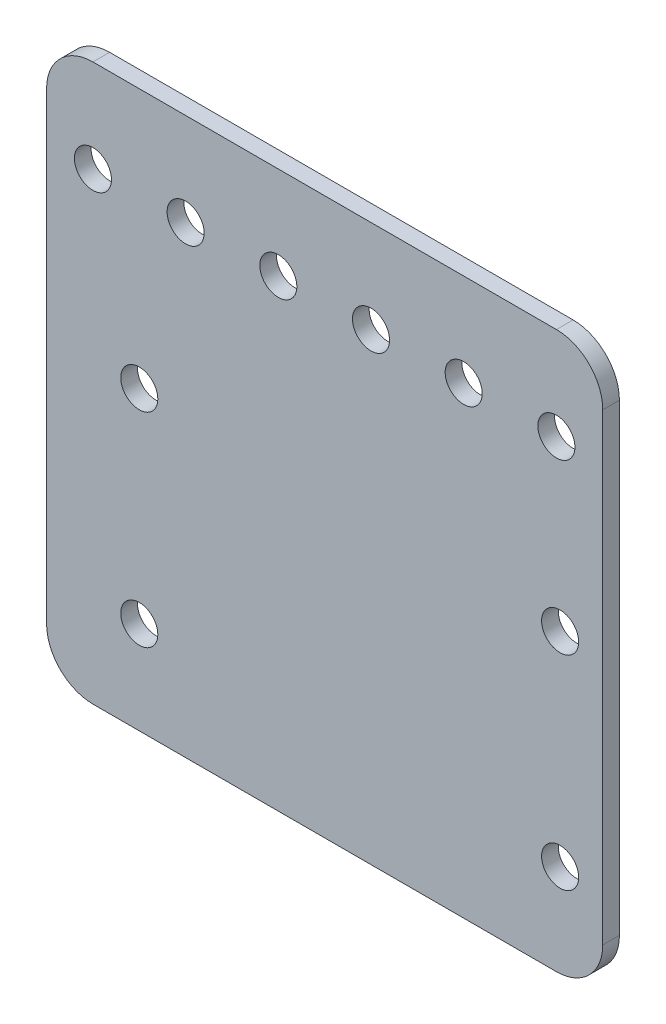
ISO-10303-21;
HEADER;
FILE_DESCRIPTION(('STEP AP214'),'2;1');
FILE_NAME('part.step','',(''),(''),'','','');
FILE_SCHEMA(('AUTOMOTIVE_DESIGN { 1 0 10303 214 1 1 1 1 }'));
ENDSEC;
DATA;
#1=APPLICATION_CONTEXT('core data for automotive mechanical design processes');
#2=APPLICATION_PROTOCOL_DEFINITION('international standard','automotive_design',2000,#1);
#3=PRODUCT_CONTEXT('',#1,'mechanical');
#4=PRODUCT('Part','Part','',(#3));
#5=PRODUCT_RELATED_PRODUCT_CATEGORY('part','',(#4));
#6=PRODUCT_DEFINITION_FORMATION('','',#4);
#7=PRODUCT_DEFINITION_CONTEXT('part definition',#1,'design');
#8=PRODUCT_DEFINITION('design','',#6,#7);
#9=PRODUCT_DEFINITION_SHAPE('','',#8);
#10=(LENGTH_UNIT() NAMED_UNIT(*) SI_UNIT(.MILLI.,.METRE.));
#11=(NAMED_UNIT(*) PLANE_ANGLE_UNIT() SI_UNIT($,.RADIAN.));
#12=(NAMED_UNIT(*) SI_UNIT($,.STERADIAN.) SOLID_ANGLE_UNIT());
#13=UNCERTAINTY_MEASURE_WITH_UNIT(LENGTH_MEASURE(1.E-05),#10,'distance_accuracy_value','');
#14=(GEOMETRIC_REPRESENTATION_CONTEXT(3) GLOBAL_UNCERTAINTY_ASSIGNED_CONTEXT((#13)) GLOBAL_UNIT_ASSIGNED_CONTEXT((#10,
#11,#12)) REPRESENTATION_CONTEXT('',''));
#15=CARTESIAN_POINT('',(0.,0.,0.));
#16=DIRECTION('',(0.,0.,1.));
#17=DIRECTION('',(1.,0.,0.));
#18=AXIS2_PLACEMENT_3D('',#15,#16,#17);
#19=CARTESIAN_POINT('',(69.85,63.5,0.));
#20=DIRECTION('',(0.,0.,1.));
#21=DIRECTION('',(1.,0.,0.));
#22=AXIS2_PLACEMENT_3D('',#19,#20,#21);
#23=CYLINDRICAL_SURFACE('',#22,2.54000000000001);
#24=CARTESIAN_POINT('',(69.85,63.5,-2.286));
#25=DIRECTION('',(0.,0.,1.));
#26=DIRECTION('',(1.,0.,0.));
#27=AXIS2_PLACEMENT_3D('',#24,#25,#26);
#28=CIRCLE('',#27,2.54000000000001);
#29=CARTESIAN_POINT('',(72.39,63.5,-2.286));
#30=VERTEX_POINT('',#29);
#31=EDGE_CURVE('E138',#30,#30,#28,.T.);
#32=ORIENTED_EDGE('',*,*,#31,.F.);
#33=EDGE_LOOP('',(#32));
#34=FACE_BOUND('',#33,.T.);
#35=CARTESIAN_POINT('',(69.85,63.5,0.));
#36=DIRECTION('',(0.,0.,1.));
#37=DIRECTION('',(1.,0.,0.));
#38=AXIS2_PLACEMENT_3D('',#35,#36,#37);
#39=CIRCLE('',#38,2.54000000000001);
#40=CARTESIAN_POINT('',(72.39,63.5,0.));
#41=VERTEX_POINT('',#40);
#42=EDGE_CURVE('E133',#41,#41,#39,.T.);
#43=ORIENTED_EDGE('',*,*,#42,.T.);
#44=EDGE_LOOP('',(#43));
#45=FACE_BOUND('',#44,.T.);
#46=ADVANCED_FACE('F39',(#34,#45),#23,.F.);
#47=CARTESIAN_POINT('',(57.15,63.5,0.));
#48=DIRECTION('',(0.,0.,1.));
#49=DIRECTION('',(1.,0.,0.));
#50=AXIS2_PLACEMENT_3D('',#47,#48,#49);
#51=CYLINDRICAL_SURFACE('',#50,2.54000000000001);
#52=CARTESIAN_POINT('',(57.15,63.5,-2.286));
#53=DIRECTION('',(0.,0.,1.));
#54=DIRECTION('',(1.,0.,0.));
#55=AXIS2_PLACEMENT_3D('',#52,#53,#54);
#56=CIRCLE('',#55,2.54000000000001);
#57=CARTESIAN_POINT('',(59.69,63.5,-2.286));
#58=VERTEX_POINT('',#57);
#59=EDGE_CURVE('E189',#58,#58,#56,.T.);
#60=ORIENTED_EDGE('',*,*,#59,.F.);
#61=EDGE_LOOP('',(#60));
#62=FACE_BOUND('',#61,.T.);
#63=CARTESIAN_POINT('',(57.15,63.5,0.));
#64=DIRECTION('',(0.,0.,1.));
#65=DIRECTION('',(1.,0.,0.));
#66=AXIS2_PLACEMENT_3D('',#63,#64,#65);
#67=CIRCLE('',#66,2.54000000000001);
#68=CARTESIAN_POINT('',(59.69,63.5,0.));
#69=VERTEX_POINT('',#68);
#70=EDGE_CURVE('E192',#69,#69,#67,.T.);
#71=ORIENTED_EDGE('',*,*,#70,.T.);
#72=EDGE_LOOP('',(#71));
#73=FACE_BOUND('',#72,.T.);
#74=ADVANCED_FACE('F201',(#62,#73),#51,.F.);
#75=CARTESIAN_POINT('',(44.45,63.5,0.));
#76=DIRECTION('',(0.,0.,1.));
#77=DIRECTION('',(1.,0.,0.));
#78=AXIS2_PLACEMENT_3D('',#75,#76,#77);
#79=CYLINDRICAL_SURFACE('',#78,2.54000000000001);
#80=CARTESIAN_POINT('',(44.45,63.5,-2.286));
#81=DIRECTION('',(0.,0.,1.));
#82=DIRECTION('',(1.,0.,0.));
#83=AXIS2_PLACEMENT_3D('',#80,#81,#82);
#84=CIRCLE('',#83,2.54000000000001);
#85=CARTESIAN_POINT('',(46.99,63.5,-2.286));
#86=VERTEX_POINT('',#85);
#87=EDGE_CURVE('E183',#86,#86,#84,.T.);
#88=ORIENTED_EDGE('',*,*,#87,.F.);
#89=EDGE_LOOP('',(#88));
#90=FACE_BOUND('',#89,.T.);
#91=CARTESIAN_POINT('',(44.45,63.5,0.));
#92=DIRECTION('',(0.,0.,1.));
#93=DIRECTION('',(1.,0.,0.));
#94=AXIS2_PLACEMENT_3D('',#91,#92,#93);
#95=CIRCLE('',#94,2.54000000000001);
#96=CARTESIAN_POINT('',(46.99,63.5,0.));
#97=VERTEX_POINT('',#96);
#98=EDGE_CURVE('E186',#97,#97,#95,.T.);
#99=ORIENTED_EDGE('',*,*,#98,.T.);
#100=EDGE_LOOP('',(#99));
#101=FACE_BOUND('',#100,.T.);
#102=ADVANCED_FACE('F235',(#90,#101),#79,.F.);
#103=CARTESIAN_POINT('',(31.75,63.5,0.));
#104=DIRECTION('',(0.,0.,1.));
#105=DIRECTION('',(1.,0.,0.));
#106=AXIS2_PLACEMENT_3D('',#103,#104,#105);
#107=CYLINDRICAL_SURFACE('',#106,2.54000000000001);
#108=CARTESIAN_POINT('',(31.75,63.5,-2.286));
#109=DIRECTION('',(0.,0.,1.));
#110=DIRECTION('',(1.,0.,0.));
#111=AXIS2_PLACEMENT_3D('',#108,#109,#110);
#112=CIRCLE('',#111,2.54000000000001);
#113=CARTESIAN_POINT('',(34.29,63.5,-2.286));
#114=VERTEX_POINT('',#113);
#115=EDGE_CURVE('E164',#114,#114,#112,.T.);
#116=ORIENTED_EDGE('',*,*,#115,.F.);
#117=EDGE_LOOP('',(#116));
#118=FACE_BOUND('',#117,.T.);
#119=CARTESIAN_POINT('',(31.75,63.5,0.));
#120=DIRECTION('',(0.,0.,1.));
#121=DIRECTION('',(1.,0.,0.));
#122=AXIS2_PLACEMENT_3D('',#119,#120,#121);
#123=CIRCLE('',#122,2.54000000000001);
#124=CARTESIAN_POINT('',(34.29,63.5,0.));
#125=VERTEX_POINT('',#124);
#126=EDGE_CURVE('E168',#125,#125,#123,.T.);
#127=ORIENTED_EDGE('',*,*,#126,.T.);
#128=EDGE_LOOP('',(#127));
#129=FACE_BOUND('',#128,.T.);
#130=ADVANCED_FACE('F232',(#118,#129),#107,.F.);
#131=CARTESIAN_POINT('',(0.,0.,-2.286));
#132=DIRECTION('',(-1.,0.,0.));
#133=DIRECTION('',(0.,0.,1.));
#134=AXIS2_PLACEMENT_3D('',#131,#132,#133);
#135=PLANE('',#134);
#136=DIRECTION('',(0.,-1.,0.));
#137=VECTOR('',#136,1.);
#138=CARTESIAN_POINT('',(0.,0.,-2.286));
#139=LINE('',#138,#137);
#140=CARTESIAN_POINT('',(0.,69.85,-2.286));
#141=VERTEX_POINT('',#140);
#142=CARTESIAN_POINT('',(0.,6.35,-2.286));
#143=VERTEX_POINT('',#142);
#144=EDGE_CURVE('E179',#141,#143,#139,.T.);
#145=ORIENTED_EDGE('',*,*,#144,.T.);
#146=DIRECTION('',(0.,0.,1.));
#147=VECTOR('',#146,1.);
#148=CARTESIAN_POINT('',(0.,6.35,-2.286));
#149=LINE('',#148,#147);
#150=CARTESIAN_POINT('',(0.,6.35,0.));
#151=VERTEX_POINT('',#150);
#152=EDGE_CURVE('E126',#143,#151,#149,.T.);
#153=ORIENTED_EDGE('',*,*,#152,.T.);
#154=DIRECTION('',(0.,-1.,0.));
#155=VECTOR('',#154,1.);
#156=CARTESIAN_POINT('',(0.,0.,0.));
#157=LINE('',#156,#155);
#158=CARTESIAN_POINT('',(0.,69.85,0.));
#159=VERTEX_POINT('',#158);
#160=EDGE_CURVE('E109',#159,#151,#157,.T.);
#161=ORIENTED_EDGE('',*,*,#160,.F.);
#162=DIRECTION('',(0.,0.,1.));
#163=VECTOR('',#162,1.);
#164=CARTESIAN_POINT('',(0.,69.85,-2.286));
#165=LINE('',#164,#163);
#166=EDGE_CURVE('E123',#159,#141,#165,.F.);
#167=ORIENTED_EDGE('',*,*,#166,.T.);
#168=EDGE_LOOP('',(#145,#153,#161,#167));
#169=FACE_BOUND('',#168,.T.);
#170=ADVANCED_FACE('F122',(#169),#135,.T.);
#171=CARTESIAN_POINT('',(0.,76.2,-2.286));
#172=DIRECTION('',(0.,1.,0.));
#173=DIRECTION('',(0.,0.,1.));
#174=AXIS2_PLACEMENT_3D('',#171,#172,#173);
#175=PLANE('',#174);
#176=DIRECTION('',(-1.,0.,0.));
#177=VECTOR('',#176,1.);
#178=CARTESIAN_POINT('',(0.,76.2,-2.286));
#179=LINE('',#178,#177);
#180=CARTESIAN_POINT('',(69.85,76.2,-2.286));
#181=VERTEX_POINT('',#180);
#182=CARTESIAN_POINT('',(6.35,76.2,-2.286));
#183=VERTEX_POINT('',#182);
#184=EDGE_CURVE('E163',#181,#183,#179,.T.);
#185=ORIENTED_EDGE('',*,*,#184,.T.);
#186=DIRECTION('',(0.,0.,1.));
#187=VECTOR('',#186,1.);
#188=CARTESIAN_POINT('',(6.35,76.2,-2.286));
#189=LINE('',#188,#187);
#190=CARTESIAN_POINT('',(6.35,76.2,0.));
#191=VERTEX_POINT('',#190);
#192=EDGE_CURVE('E158',#183,#191,#189,.T.);
#193=ORIENTED_EDGE('',*,*,#192,.T.);
#194=DIRECTION('',(-1.,0.,0.));
#195=VECTOR('',#194,1.);
#196=CARTESIAN_POINT('',(0.,76.2,0.));
#197=LINE('',#196,#195);
#198=CARTESIAN_POINT('',(69.85,76.2,0.));
#199=VERTEX_POINT('',#198);
#200=EDGE_CURVE('E111',#199,#191,#197,.T.);
#201=ORIENTED_EDGE('',*,*,#200,.F.);
#202=DIRECTION('',(0.,0.,1.));
#203=VECTOR('',#202,1.);
#204=CARTESIAN_POINT('',(69.85,76.2,-2.286));
#205=LINE('',#204,#203);
#206=EDGE_CURVE('E156',#199,#181,#205,.F.);
#207=ORIENTED_EDGE('',*,*,#206,.T.);
#208=EDGE_LOOP('',(#185,#193,#201,#207));
#209=FACE_BOUND('',#208,.T.);
#210=ADVANCED_FACE('F161',(#209),#175,.T.);
#211=CARTESIAN_POINT('',(76.2,0.,-2.286));
#212=DIRECTION('',(1.,0.,0.));
#213=DIRECTION('',(0.,0.,-1.));
#214=AXIS2_PLACEMENT_3D('',#211,#212,#213);
#215=PLANE('',#214);
#216=DIRECTION('',(0.,1.,0.));
#217=VECTOR('',#216,1.);
#218=CARTESIAN_POINT('',(76.2,0.,-2.286));
#219=LINE('',#218,#217);
#220=CARTESIAN_POINT('',(76.2,6.35,-2.286));
#221=VERTEX_POINT('',#220);
#222=CARTESIAN_POINT('',(76.2,69.85,-2.286));
#223=VERTEX_POINT('',#222);
#224=EDGE_CURVE('E165',#221,#223,#219,.T.);
#225=ORIENTED_EDGE('',*,*,#224,.T.);
#226=DIRECTION('',(0.,0.,1.));
#227=VECTOR('',#226,1.);
#228=CARTESIAN_POINT('',(76.2,69.85,-2.286));
#229=LINE('',#228,#227);
#230=CARTESIAN_POINT('',(76.2,69.85,0.));
#231=VERTEX_POINT('',#230);
#232=EDGE_CURVE('E11',#223,#231,#229,.T.);
#233=ORIENTED_EDGE('',*,*,#232,.T.);
#234=DIRECTION('',(0.,1.,0.));
#235=VECTOR('',#234,1.);
#236=CARTESIAN_POINT('',(76.2,0.,0.));
#237=LINE('',#236,#235);
#238=CARTESIAN_POINT('',(76.2,6.35,0.));
#239=VERTEX_POINT('',#238);
#240=EDGE_CURVE('E176',#239,#231,#237,.T.);
#241=ORIENTED_EDGE('',*,*,#240,.F.);
#242=DIRECTION('',(0.,0.,1.));
#243=VECTOR('',#242,1.);
#244=CARTESIAN_POINT('',(76.2,6.35,-2.286));
#245=LINE('',#244,#243);
#246=EDGE_CURVE('E47',#239,#221,#245,.F.);
#247=ORIENTED_EDGE('',*,*,#246,.T.);
#248=EDGE_LOOP('',(#225,#233,#241,#247));
#249=FACE_BOUND('',#248,.T.);
#250=ADVANCED_FACE('F224',(#249),#215,.T.);
#251=CARTESIAN_POINT('',(0.,0.,-2.286));
#252=DIRECTION('',(0.,-1.,0.));
#253=DIRECTION('',(0.,0.,-1.));
#254=AXIS2_PLACEMENT_3D('',#251,#252,#253);
#255=PLANE('',#254);
#256=DIRECTION('',(1.,0.,0.));
#257=VECTOR('',#256,1.);
#258=CARTESIAN_POINT('',(0.,0.,0.));
#259=LINE('',#258,#257);
#260=CARTESIAN_POINT('',(6.35,0.,0.));
#261=VERTEX_POINT('',#260);
#262=CARTESIAN_POINT('',(69.85,0.,0.));
#263=VERTEX_POINT('',#262);
#264=EDGE_CURVE('E127',#261,#263,#259,.T.);
#265=ORIENTED_EDGE('',*,*,#264,.F.);
#266=DIRECTION('',(0.,0.,1.));
#267=VECTOR('',#266,1.);
#268=CARTESIAN_POINT('',(6.35,0.,-2.286));
#269=LINE('',#268,#267);
#270=CARTESIAN_POINT('',(6.35,0.,-2.286));
#271=VERTEX_POINT('',#270);
#272=EDGE_CURVE('E148',#261,#271,#269,.F.);
#273=ORIENTED_EDGE('',*,*,#272,.T.);
#274=DIRECTION('',(1.,0.,0.));
#275=VECTOR('',#274,1.);
#276=CARTESIAN_POINT('',(0.,0.,-2.286));
#277=LINE('',#276,#275);
#278=CARTESIAN_POINT('',(69.85,0.,-2.286));
#279=VERTEX_POINT('',#278);
#280=EDGE_CURVE('E170',#271,#279,#277,.T.);
#281=ORIENTED_EDGE('',*,*,#280,.T.);
#282=DIRECTION('',(0.,0.,1.));
#283=VECTOR('',#282,1.);
#284=CARTESIAN_POINT('',(69.85,0.,-2.286));
#285=LINE('',#284,#283);
#286=EDGE_CURVE('E145',#279,#263,#285,.T.);
#287=ORIENTED_EDGE('',*,*,#286,.T.);
#288=EDGE_LOOP('',(#265,#273,#281,#287));
#289=FACE_BOUND('',#288,.T.);
#290=ADVANCED_FACE('F216',(#289),#255,.T.);
#291=CARTESIAN_POINT('',(0.,0.,-2.286));
#292=DIRECTION('',(0.,0.,-1.));
#293=DIRECTION('',(-1.,0.,0.));
#294=AXIS2_PLACEMENT_3D('',#291,#292,#293);
#295=PLANE('',#294);
#296=CARTESIAN_POINT('',(70.358,12.7,-2.286));
#297=DIRECTION('',(0.,0.,-1.));
#298=DIRECTION('',(-1.,0.,0.));
#299=AXIS2_PLACEMENT_3D('',#296,#297,#298);
#300=CIRCLE('',#299,2.54);
#301=CARTESIAN_POINT('',(67.818,12.7,-2.286));
#302=VERTEX_POINT('',#301);
#303=EDGE_CURVE('E283',#302,#302,#300,.T.);
#304=ORIENTED_EDGE('',*,*,#303,.F.);
#305=EDGE_LOOP('',(#304));
#306=FACE_BOUND('',#305,.T.);
#307=CARTESIAN_POINT('',(70.358,40.64,-2.286));
#308=DIRECTION('',(0.,0.,-1.));
#309=DIRECTION('',(-1.,0.,0.));
#310=AXIS2_PLACEMENT_3D('',#307,#308,#309);
#311=CIRCLE('',#310,2.54);
#312=CARTESIAN_POINT('',(67.818,40.64,-2.286));
#313=VERTEX_POINT('',#312);
#314=EDGE_CURVE('E286',#313,#313,#311,.T.);
#315=ORIENTED_EDGE('',*,*,#314,.F.);
#316=EDGE_LOOP('',(#315));
#317=FACE_BOUND('',#316,.T.);
#318=CARTESIAN_POINT('',(12.7,40.64,-2.286));
#319=DIRECTION('',(0.,0.,-1.));
#320=DIRECTION('',(-1.,0.,0.));
#321=AXIS2_PLACEMENT_3D('',#318,#319,#320);
#322=CIRCLE('',#321,2.54);
#323=CARTESIAN_POINT('',(10.16,40.64,-2.286));
#324=VERTEX_POINT('',#323);
#325=EDGE_CURVE('E289',#324,#324,#322,.T.);
#326=ORIENTED_EDGE('',*,*,#325,.F.);
#327=EDGE_LOOP('',(#326));
#328=FACE_BOUND('',#327,.T.);
#329=CARTESIAN_POINT('',(12.7,12.7,-2.286));
#330=DIRECTION('',(0.,0.,-1.));
#331=DIRECTION('',(-1.,0.,0.));
#332=AXIS2_PLACEMENT_3D('',#329,#330,#331);
#333=CIRCLE('',#332,2.54);
#334=CARTESIAN_POINT('',(10.16,12.7,-2.286));
#335=VERTEX_POINT('',#334);
#336=EDGE_CURVE('E277',#335,#335,#333,.T.);
#337=ORIENTED_EDGE('',*,*,#336,.F.);
#338=EDGE_LOOP('',(#337));
#339=FACE_BOUND('',#338,.T.);
#340=CARTESIAN_POINT('',(19.05,63.5,-2.286));
#341=DIRECTION('',(0.,0.,1.));
#342=DIRECTION('',(1.,0.,0.));
#343=AXIS2_PLACEMENT_3D('',#340,#341,#342);
#344=CIRCLE('',#343,2.54000000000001);
#345=CARTESIAN_POINT('',(21.59,63.5,-2.286));
#346=VERTEX_POINT('',#345);
#347=EDGE_CURVE('E274',#346,#346,#344,.T.);
#348=ORIENTED_EDGE('',*,*,#347,.T.);
#349=EDGE_LOOP('',(#348));
#350=FACE_BOUND('',#349,.T.);
#351=CARTESIAN_POINT('',(6.34999999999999,63.5,-2.286));
#352=DIRECTION('',(0.,0.,1.));
#353=DIRECTION('',(1.,0.,0.));
#354=AXIS2_PLACEMENT_3D('',#351,#352,#353);
#355=CIRCLE('',#354,2.54000000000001);
#356=CARTESIAN_POINT('',(8.89000000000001,63.5,-2.286));
#357=VERTEX_POINT('',#356);
#358=EDGE_CURVE('E128',#357,#357,#355,.T.);
#359=ORIENTED_EDGE('',*,*,#358,.T.);
#360=EDGE_LOOP('',(#359));
#361=FACE_BOUND('',#360,.T.);
#362=ORIENTED_EDGE('',*,*,#280,.F.);
#363=CARTESIAN_POINT('',(6.35,6.35,-2.286));
#364=DIRECTION('',(0.,0.,-1.));
#365=DIRECTION('',(-1.,0.,0.));
#366=AXIS2_PLACEMENT_3D('',#363,#364,#365);
#367=CIRCLE('',#366,6.35);
#368=EDGE_CURVE('E154',#271,#143,#367,.T.);
#369=ORIENTED_EDGE('',*,*,#368,.T.);
#370=ORIENTED_EDGE('',*,*,#144,.F.);
#371=CARTESIAN_POINT('',(6.35,69.85,-2.286));
#372=DIRECTION('',(0.,0.,-1.));
#373=DIRECTION('',(-1.,0.,0.));
#374=AXIS2_PLACEMENT_3D('',#371,#372,#373);
#375=CIRCLE('',#374,6.35);
#376=EDGE_CURVE('E132',#141,#183,#375,.T.);
#377=ORIENTED_EDGE('',*,*,#376,.T.);
#378=ORIENTED_EDGE('',*,*,#184,.F.);
#379=CARTESIAN_POINT('',(69.85,69.85,-2.286));
#380=DIRECTION('',(0.,0.,-1.));
#381=DIRECTION('',(-1.,0.,0.));
#382=AXIS2_PLACEMENT_3D('',#379,#380,#381);
#383=CIRCLE('',#382,6.35);
#384=EDGE_CURVE('E54',#181,#223,#383,.T.);
#385=ORIENTED_EDGE('',*,*,#384,.T.);
#386=ORIENTED_EDGE('',*,*,#224,.F.);
#387=CARTESIAN_POINT('',(69.85,6.35,-2.286));
#388=DIRECTION('',(0.,0.,-1.));
#389=DIRECTION('',(-1.,0.,0.));
#390=AXIS2_PLACEMENT_3D('',#387,#388,#389);
#391=CIRCLE('',#390,6.35);
#392=EDGE_CURVE('E150',#221,#279,#391,.T.);
#393=ORIENTED_EDGE('',*,*,#392,.T.);
#394=EDGE_LOOP('',(#362,#369,#370,#377,#378,#385,#386,#393));
#395=FACE_BOUND('',#394,.T.);
#396=ORIENTED_EDGE('',*,*,#115,.T.);
#397=EDGE_LOOP('',(#396));
#398=FACE_BOUND('',#397,.T.);
#399=ORIENTED_EDGE('',*,*,#87,.T.);
#400=EDGE_LOOP('',(#399));
#401=FACE_BOUND('',#400,.T.);
#402=ORIENTED_EDGE('',*,*,#59,.T.);
#403=EDGE_LOOP('',(#402));
#404=FACE_BOUND('',#403,.T.);
#405=ORIENTED_EDGE('',*,*,#31,.T.);
#406=EDGE_LOOP('',(#405));
#407=FACE_BOUND('',#406,.T.);
#408=ADVANCED_FACE('F197',(#306,#317,#328,#339,#350,#361,#395,#398,#401,#404,#407),#295,.T.);
#409=CARTESIAN_POINT('',(0.,0.,0.));
#410=DIRECTION('',(0.,0.,-1.));
#411=DIRECTION('',(-1.,0.,0.));
#412=AXIS2_PLACEMENT_3D('',#409,#410,#411);
#413=PLANE('',#412);
#414=CARTESIAN_POINT('',(70.358,12.7,0.));
#415=DIRECTION('',(0.,0.,1.));
#416=DIRECTION('',(1.,0.,0.));
#417=AXIS2_PLACEMENT_3D('',#414,#415,#416);
#418=CIRCLE('',#417,2.54);
#419=CARTESIAN_POINT('',(72.898,12.7,0.));
#420=VERTEX_POINT('',#419);
#421=EDGE_CURVE('E292',#420,#420,#418,.T.);
#422=ORIENTED_EDGE('',*,*,#421,.F.);
#423=EDGE_LOOP('',(#422));
#424=FACE_BOUND('',#423,.T.);
#425=CARTESIAN_POINT('',(70.358,40.64,0.));
#426=DIRECTION('',(0.,0.,1.));
#427=DIRECTION('',(1.,0.,0.));
#428=AXIS2_PLACEMENT_3D('',#425,#426,#427);
#429=CIRCLE('',#428,2.54);
#430=CARTESIAN_POINT('',(72.898,40.64,0.));
#431=VERTEX_POINT('',#430);
#432=EDGE_CURVE('E296',#431,#431,#429,.T.);
#433=ORIENTED_EDGE('',*,*,#432,.F.);
#434=EDGE_LOOP('',(#433));
#435=FACE_BOUND('',#434,.T.);
#436=CARTESIAN_POINT('',(12.7,40.64,0.));
#437=DIRECTION('',(0.,0.,1.));
#438=DIRECTION('',(1.,0.,0.));
#439=AXIS2_PLACEMENT_3D('',#436,#437,#438);
#440=CIRCLE('',#439,2.54);
#441=CARTESIAN_POINT('',(15.24,40.64,0.));
#442=VERTEX_POINT('',#441);
#443=EDGE_CURVE('E293',#442,#442,#440,.T.);
#444=ORIENTED_EDGE('',*,*,#443,.F.);
#445=EDGE_LOOP('',(#444));
#446=FACE_BOUND('',#445,.T.);
#447=CARTESIAN_POINT('',(12.7,12.7,0.));
#448=DIRECTION('',(0.,0.,1.));
#449=DIRECTION('',(1.,0.,0.));
#450=AXIS2_PLACEMENT_3D('',#447,#448,#449);
#451=CIRCLE('',#450,2.54);
#452=CARTESIAN_POINT('',(15.24,12.7,0.));
#453=VERTEX_POINT('',#452);
#454=EDGE_CURVE('E280',#453,#453,#451,.T.);
#455=ORIENTED_EDGE('',*,*,#454,.F.);
#456=EDGE_LOOP('',(#455));
#457=FACE_BOUND('',#456,.T.);
#458=CARTESIAN_POINT('',(19.05,63.5,0.));
#459=DIRECTION('',(0.,0.,1.));
#460=DIRECTION('',(1.,0.,0.));
#461=AXIS2_PLACEMENT_3D('',#458,#459,#460);
#462=CIRCLE('',#461,2.54000000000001);
#463=CARTESIAN_POINT('',(21.59,63.5,0.));
#464=VERTEX_POINT('',#463);
#465=EDGE_CURVE('E271',#464,#464,#462,.T.);
#466=ORIENTED_EDGE('',*,*,#465,.F.);
#467=EDGE_LOOP('',(#466));
#468=FACE_BOUND('',#467,.T.);
#469=CARTESIAN_POINT('',(6.34999999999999,63.5,0.));
#470=DIRECTION('',(0.,0.,1.));
#471=DIRECTION('',(1.,0.,0.));
#472=AXIS2_PLACEMENT_3D('',#469,#470,#471);
#473=CIRCLE('',#472,2.54000000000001);
#474=CARTESIAN_POINT('',(8.89000000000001,63.5,0.));
#475=VERTEX_POINT('',#474);
#476=EDGE_CURVE('E268',#475,#475,#473,.T.);
#477=ORIENTED_EDGE('',*,*,#476,.F.);
#478=EDGE_LOOP('',(#477));
#479=FACE_BOUND('',#478,.T.);
#480=ORIENTED_EDGE('',*,*,#160,.T.);
#481=CARTESIAN_POINT('',(6.35,6.35,0.));
#482=DIRECTION('',(0.,0.,-1.));
#483=DIRECTION('',(-1.,0.,0.));
#484=AXIS2_PLACEMENT_3D('',#481,#482,#483);
#485=CIRCLE('',#484,6.35);
#486=EDGE_CURVE('E116',#151,#261,#485,.F.);
#487=ORIENTED_EDGE('',*,*,#486,.T.);
#488=ORIENTED_EDGE('',*,*,#264,.T.);
#489=CARTESIAN_POINT('',(69.85,6.35,0.));
#490=DIRECTION('',(0.,0.,-1.));
#491=DIRECTION('',(-1.,0.,0.));
#492=AXIS2_PLACEMENT_3D('',#489,#490,#491);
#493=CIRCLE('',#492,6.35);
#494=EDGE_CURVE('E135',#263,#239,#493,.F.);
#495=ORIENTED_EDGE('',*,*,#494,.T.);
#496=ORIENTED_EDGE('',*,*,#240,.T.);
#497=CARTESIAN_POINT('',(69.85,69.85,0.));
#498=DIRECTION('',(0.,0.,-1.));
#499=DIRECTION('',(-1.,0.,0.));
#500=AXIS2_PLACEMENT_3D('',#497,#498,#499);
#501=CIRCLE('',#500,6.35);
#502=EDGE_CURVE('E117',#231,#199,#501,.F.);
#503=ORIENTED_EDGE('',*,*,#502,.T.);
#504=ORIENTED_EDGE('',*,*,#200,.T.);
#505=CARTESIAN_POINT('',(6.35,69.85,0.));
#506=DIRECTION('',(0.,0.,-1.));
#507=DIRECTION('',(-1.,0.,0.));
#508=AXIS2_PLACEMENT_3D('',#505,#506,#507);
#509=CIRCLE('',#508,6.35);
#510=EDGE_CURVE('E105',#191,#159,#509,.F.);
#511=ORIENTED_EDGE('',*,*,#510,.T.);
#512=EDGE_LOOP('',(#480,#487,#488,#495,#496,#503,#504,#511));
#513=FACE_BOUND('',#512,.T.);
#514=ORIENTED_EDGE('',*,*,#126,.F.);
#515=EDGE_LOOP('',(#514));
#516=FACE_BOUND('',#515,.T.);
#517=ORIENTED_EDGE('',*,*,#98,.F.);
#518=EDGE_LOOP('',(#517));
#519=FACE_BOUND('',#518,.T.);
#520=ORIENTED_EDGE('',*,*,#70,.F.);
#521=EDGE_LOOP('',(#520));
#522=FACE_BOUND('',#521,.T.);
#523=ORIENTED_EDGE('',*,*,#42,.F.);
#524=EDGE_LOOP('',(#523));
#525=FACE_BOUND('',#524,.T.);
#526=ADVANCED_FACE('F107',(#424,#435,#446,#457,#468,#479,#513,#516,#519,#522,#525),#413,.F.);
#527=CARTESIAN_POINT('',(6.34999999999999,63.5,0.));
#528=DIRECTION('',(0.,0.,1.));
#529=DIRECTION('',(1.,0.,0.));
#530=AXIS2_PLACEMENT_3D('',#527,#528,#529);
#531=CYLINDRICAL_SURFACE('',#530,2.54000000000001);
#532=ORIENTED_EDGE('',*,*,#358,.F.);
#533=EDGE_LOOP('',(#532));
#534=FACE_BOUND('',#533,.T.);
#535=ORIENTED_EDGE('',*,*,#476,.T.);
#536=EDGE_LOOP('',(#535));
#537=FACE_BOUND('',#536,.T.);
#538=ADVANCED_FACE('F206',(#534,#537),#531,.F.);
#539=CARTESIAN_POINT('',(19.05,63.5,0.));
#540=DIRECTION('',(0.,0.,1.));
#541=DIRECTION('',(1.,0.,0.));
#542=AXIS2_PLACEMENT_3D('',#539,#540,#541);
#543=CYLINDRICAL_SURFACE('',#542,2.54000000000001);
#544=ORIENTED_EDGE('',*,*,#347,.F.);
#545=EDGE_LOOP('',(#544));
#546=FACE_BOUND('',#545,.T.);
#547=ORIENTED_EDGE('',*,*,#465,.T.);
#548=EDGE_LOOP('',(#547));
#549=FACE_BOUND('',#548,.T.);
#550=ADVANCED_FACE('F213',(#546,#549),#543,.F.);
#551=CARTESIAN_POINT('',(6.35,6.35,-2.286));
#552=DIRECTION('',(0.,0.,1.));
#553=DIRECTION('',(1.,0.,0.));
#554=AXIS2_PLACEMENT_3D('',#551,#552,#553);
#555=CYLINDRICAL_SURFACE('',#554,6.35);
#556=ORIENTED_EDGE('',*,*,#368,.F.);
#557=ORIENTED_EDGE('',*,*,#272,.F.);
#558=ORIENTED_EDGE('',*,*,#486,.F.);
#559=ORIENTED_EDGE('',*,*,#152,.F.);
#560=EDGE_LOOP('',(#556,#557,#558,#559));
#561=FACE_BOUND('',#560,.T.);
#562=ADVANCED_FACE('F243',(#561),#555,.T.);
#563=CARTESIAN_POINT('',(6.35,69.85,-2.286));
#564=DIRECTION('',(0.,0.,1.));
#565=DIRECTION('',(1.,0.,0.));
#566=AXIS2_PLACEMENT_3D('',#563,#564,#565);
#567=CYLINDRICAL_SURFACE('',#566,6.35);
#568=ORIENTED_EDGE('',*,*,#376,.F.);
#569=ORIENTED_EDGE('',*,*,#166,.F.);
#570=ORIENTED_EDGE('',*,*,#510,.F.);
#571=ORIENTED_EDGE('',*,*,#192,.F.);
#572=EDGE_LOOP('',(#568,#569,#570,#571));
#573=FACE_BOUND('',#572,.T.);
#574=ADVANCED_FACE('F131',(#573),#567,.T.);
#575=CARTESIAN_POINT('',(69.85,69.85,-2.286));
#576=DIRECTION('',(0.,0.,1.));
#577=DIRECTION('',(1.,0.,0.));
#578=AXIS2_PLACEMENT_3D('',#575,#576,#577);
#579=CYLINDRICAL_SURFACE('',#578,6.35);
#580=ORIENTED_EDGE('',*,*,#384,.F.);
#581=ORIENTED_EDGE('',*,*,#206,.F.);
#582=ORIENTED_EDGE('',*,*,#502,.F.);
#583=ORIENTED_EDGE('',*,*,#232,.F.);
#584=EDGE_LOOP('',(#580,#581,#582,#583));
#585=FACE_BOUND('',#584,.T.);
#586=ADVANCED_FACE('F248',(#585),#579,.T.);
#587=CARTESIAN_POINT('',(69.85,6.35,-2.286));
#588=DIRECTION('',(0.,0.,1.));
#589=DIRECTION('',(1.,0.,0.));
#590=AXIS2_PLACEMENT_3D('',#587,#588,#589);
#591=CYLINDRICAL_SURFACE('',#590,6.35);
#592=ORIENTED_EDGE('',*,*,#392,.F.);
#593=ORIENTED_EDGE('',*,*,#246,.F.);
#594=ORIENTED_EDGE('',*,*,#494,.F.);
#595=ORIENTED_EDGE('',*,*,#286,.F.);
#596=EDGE_LOOP('',(#592,#593,#594,#595));
#597=FACE_BOUND('',#596,.T.);
#598=ADVANCED_FACE('F41',(#597),#591,.T.);
#599=CARTESIAN_POINT('',(12.7,12.7,-2.54));
#600=DIRECTION('',(0.,0.,1.));
#601=DIRECTION('',(1.,0.,0.));
#602=AXIS2_PLACEMENT_3D('',#599,#600,#601);
#603=CYLINDRICAL_SURFACE('',#602,2.54);
#604=ORIENTED_EDGE('',*,*,#336,.T.);
#605=EDGE_LOOP('',(#604));
#606=FACE_BOUND('',#605,.T.);
#607=ORIENTED_EDGE('',*,*,#454,.T.);
#608=EDGE_LOOP('',(#607));
#609=FACE_BOUND('',#608,.T.);
#610=ADVANCED_FACE('F254',(#606,#609),#603,.F.);
#611=CARTESIAN_POINT('',(12.7,40.64,-2.54));
#612=DIRECTION('',(0.,0.,1.));
#613=DIRECTION('',(1.,0.,0.));
#614=AXIS2_PLACEMENT_3D('',#611,#612,#613);
#615=CYLINDRICAL_SURFACE('',#614,2.54);
#616=ORIENTED_EDGE('',*,*,#325,.T.);
#617=EDGE_LOOP('',(#616));
#618=FACE_BOUND('',#617,.T.);
#619=ORIENTED_EDGE('',*,*,#443,.T.);
#620=EDGE_LOOP('',(#619));
#621=FACE_BOUND('',#620,.T.);
#622=ADVANCED_FACE('F309',(#618,#621),#615,.F.);
#623=CARTESIAN_POINT('',(70.358,40.64,-2.54));
#624=DIRECTION('',(0.,0.,1.));
#625=DIRECTION('',(1.,0.,0.));
#626=AXIS2_PLACEMENT_3D('',#623,#624,#625);
#627=CYLINDRICAL_SURFACE('',#626,2.54);
#628=ORIENTED_EDGE('',*,*,#314,.T.);
#629=EDGE_LOOP('',(#628));
#630=FACE_BOUND('',#629,.T.);
#631=ORIENTED_EDGE('',*,*,#432,.T.);
#632=EDGE_LOOP('',(#631));
#633=FACE_BOUND('',#632,.T.);
#634=ADVANCED_FACE('F303',(#630,#633),#627,.F.);
#635=CARTESIAN_POINT('',(70.358,12.7,-2.54));
#636=DIRECTION('',(0.,0.,1.));
#637=DIRECTION('',(1.,0.,0.));
#638=AXIS2_PLACEMENT_3D('',#635,#636,#637);
#639=CYLINDRICAL_SURFACE('',#638,2.54);
#640=ORIENTED_EDGE('',*,*,#303,.T.);
#641=EDGE_LOOP('',(#640));
#642=FACE_BOUND('',#641,.T.);
#643=ORIENTED_EDGE('',*,*,#421,.T.);
#644=EDGE_LOOP('',(#643));
#645=FACE_BOUND('',#644,.T.);
#646=ADVANCED_FACE('F301',(#642,#645),#639,.F.);
#647=CLOSED_SHELL('',(#46,#74,#102,#130,#170,#210,#250,#290,#408,#526,#538,#550,#562,#574,#586,
#598,#610,#622,#634,#646));
#648=MANIFOLD_SOLID_BREP('B2',#647);
#649=ADVANCED_BREP_SHAPE_REPRESENTATION('',(#18,#648),#14);
#650=SHAPE_DEFINITION_REPRESENTATION(#9,#649);
ENDSEC;
END-ISO-10303-21;
